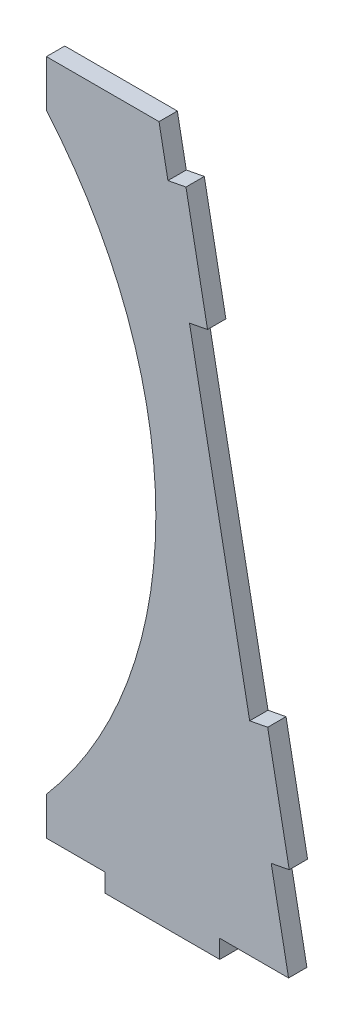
ISO-10303-21;
HEADER;
FILE_DESCRIPTION(('STEP AP214'),'2;1');
FILE_NAME('part.step','',(''),(''),'','','');
FILE_SCHEMA(('AUTOMOTIVE_DESIGN { 1 0 10303 214 1 1 1 1 }'));
ENDSEC;
DATA;
#1=APPLICATION_CONTEXT('core data for automotive mechanical design processes');
#2=APPLICATION_PROTOCOL_DEFINITION('international standard','automotive_design',2000,#1);
#3=PRODUCT_CONTEXT('',#1,'mechanical');
#4=PRODUCT('Part','Part','',(#3));
#5=PRODUCT_RELATED_PRODUCT_CATEGORY('part','',(#4));
#6=PRODUCT_DEFINITION_FORMATION('','',#4);
#7=PRODUCT_DEFINITION_CONTEXT('part definition',#1,'design');
#8=PRODUCT_DEFINITION('design','',#6,#7);
#9=PRODUCT_DEFINITION_SHAPE('','',#8);
#10=(LENGTH_UNIT() NAMED_UNIT(*) SI_UNIT(.MILLI.,.METRE.));
#11=(NAMED_UNIT(*) PLANE_ANGLE_UNIT() SI_UNIT($,.RADIAN.));
#12=(NAMED_UNIT(*) SI_UNIT($,.STERADIAN.) SOLID_ANGLE_UNIT());
#13=UNCERTAINTY_MEASURE_WITH_UNIT(LENGTH_MEASURE(1.E-05),#10,'distance_accuracy_value','');
#14=(GEOMETRIC_REPRESENTATION_CONTEXT(3) GLOBAL_UNCERTAINTY_ASSIGNED_CONTEXT((#13)) GLOBAL_UNIT_ASSIGNED_CONTEXT((#10,
#11,#12)) REPRESENTATION_CONTEXT('',''));
#15=CARTESIAN_POINT('',(0.,0.,0.));
#16=DIRECTION('',(0.,0.,1.));
#17=DIRECTION('',(1.,0.,0.));
#18=AXIS2_PLACEMENT_3D('',#15,#16,#17);
#19=CARTESIAN_POINT('',(28.5736769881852,1.143,1.524));
#20=DIRECTION('',(0.,1.,0.));
#21=DIRECTION('',(0.,0.,1.));
#22=AXIS2_PLACEMENT_3D('',#19,#20,#21);
#23=PLANE('',#22);
#24=DIRECTION('',(1.,0.,0.));
#25=VECTOR('',#24,1.);
#26=CARTESIAN_POINT('',(28.5736769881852,1.143,0.));
#27=LINE('',#26,#25);
#28=CARTESIAN_POINT('',(28.5736769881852,1.143,0.));
#29=VERTEX_POINT('',#28);
#30=CARTESIAN_POINT('',(33.443650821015,1.143,0.));
#31=VERTEX_POINT('',#30);
#32=EDGE_CURVE('E192',#29,#31,#27,.T.);
#33=ORIENTED_EDGE('',*,*,#32,.T.);
#34=DIRECTION('',(0.,0.,-1.));
#35=VECTOR('',#34,1.);
#36=CARTESIAN_POINT('',(33.443650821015,1.143,1.524));
#37=LINE('',#36,#35);
#38=CARTESIAN_POINT('',(33.443650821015,1.143,1.524));
#39=VERTEX_POINT('',#38);
#40=EDGE_CURVE('E11',#39,#31,#37,.T.);
#41=ORIENTED_EDGE('',*,*,#40,.F.);
#42=DIRECTION('',(1.,0.,0.));
#43=VECTOR('',#42,1.);
#44=CARTESIAN_POINT('',(28.5736769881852,1.143,1.524));
#45=LINE('',#44,#43);
#46=CARTESIAN_POINT('',(28.5736769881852,1.143,1.524));
#47=VERTEX_POINT('',#46);
#48=EDGE_CURVE('E226',#47,#39,#45,.T.);
#49=ORIENTED_EDGE('',*,*,#48,.F.);
#50=DIRECTION('',(0.,0.,-1.));
#51=VECTOR('',#50,1.);
#52=CARTESIAN_POINT('',(28.5736769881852,1.143,1.524));
#53=LINE('',#52,#51);
#54=EDGE_CURVE('E188',#47,#29,#53,.T.);
#55=ORIENTED_EDGE('',*,*,#54,.T.);
#56=EDGE_LOOP('',(#33,#41,#49,#55));
#57=FACE_BOUND('',#56,.T.);
#58=ADVANCED_FACE('F36',(#57),#23,.F.);
#59=CARTESIAN_POINT('',(33.443650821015,1.143,1.524));
#60=DIRECTION('',(1.,0.,0.));
#61=DIRECTION('',(0.,0.,-1.));
#62=AXIS2_PLACEMENT_3D('',#59,#60,#61);
#63=PLANE('',#62);
#64=DIRECTION('',(0.,-1.,0.));
#65=VECTOR('',#64,1.);
#66=CARTESIAN_POINT('',(33.443650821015,1.143,0.));
#67=LINE('',#66,#65);
#68=CARTESIAN_POINT('',(33.443650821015,-0.381,0.));
#69=VERTEX_POINT('',#68);
#70=EDGE_CURVE('E195',#31,#69,#67,.T.);
#71=ORIENTED_EDGE('',*,*,#70,.T.);
#72=DIRECTION('',(0.,0.,-1.));
#73=VECTOR('',#72,1.);
#74=CARTESIAN_POINT('',(33.443650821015,-0.381,1.524));
#75=LINE('',#74,#73);
#76=CARTESIAN_POINT('',(33.443650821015,-0.381,1.524));
#77=VERTEX_POINT('',#76);
#78=EDGE_CURVE('E44',#77,#69,#75,.T.);
#79=ORIENTED_EDGE('',*,*,#78,.F.);
#80=DIRECTION('',(0.,-1.,0.));
#81=VECTOR('',#80,1.);
#82=CARTESIAN_POINT('',(33.443650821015,1.143,1.524));
#83=LINE('',#82,#81);
#84=EDGE_CURVE('E125',#39,#77,#83,.T.);
#85=ORIENTED_EDGE('',*,*,#84,.F.);
#86=ORIENTED_EDGE('',*,*,#40,.T.);
#87=EDGE_LOOP('',(#71,#79,#85,#86));
#88=FACE_BOUND('',#87,.T.);
#89=ADVANCED_FACE('F334',(#88),#63,.F.);
#90=CARTESIAN_POINT('',(33.443650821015,-0.381,1.524));
#91=DIRECTION('',(0.,1.,0.));
#92=DIRECTION('',(0.,0.,1.));
#93=AXIS2_PLACEMENT_3D('',#90,#91,#92);
#94=PLANE('',#93);
#95=DIRECTION('',(1.,0.,0.));
#96=VECTOR('',#95,1.);
#97=CARTESIAN_POINT('',(33.443650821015,-0.381,0.));
#98=LINE('',#97,#96);
#99=CARTESIAN_POINT('',(42.968650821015,-0.381,0.));
#100=VERTEX_POINT('',#99);
#101=EDGE_CURVE('E197',#69,#100,#98,.T.);
#102=ORIENTED_EDGE('',*,*,#101,.T.);
#103=DIRECTION('',(0.,0.,-1.));
#104=VECTOR('',#103,1.);
#105=CARTESIAN_POINT('',(42.968650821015,-0.381,1.524));
#106=LINE('',#105,#104);
#107=CARTESIAN_POINT('',(42.968650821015,-0.381,1.524));
#108=VERTEX_POINT('',#107);
#109=EDGE_CURVE('E263',#108,#100,#106,.T.);
#110=ORIENTED_EDGE('',*,*,#109,.F.);
#111=DIRECTION('',(1.,0.,0.));
#112=VECTOR('',#111,1.);
#113=CARTESIAN_POINT('',(33.443650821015,-0.381,1.524));
#114=LINE('',#113,#112);
#115=EDGE_CURVE('E271',#77,#108,#114,.T.);
#116=ORIENTED_EDGE('',*,*,#115,.F.);
#117=ORIENTED_EDGE('',*,*,#78,.T.);
#118=EDGE_LOOP('',(#102,#110,#116,#117));
#119=FACE_BOUND('',#118,.T.);
#120=ADVANCED_FACE('F269',(#119),#94,.F.);
#121=CARTESIAN_POINT('',(42.968650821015,-0.381,1.524));
#122=DIRECTION('',(-1.,0.,0.));
#123=DIRECTION('',(0.,0.,1.));
#124=AXIS2_PLACEMENT_3D('',#121,#122,#123);
#125=PLANE('',#124);
#126=DIRECTION('',(0.,1.,0.));
#127=VECTOR('',#126,1.);
#128=CARTESIAN_POINT('',(42.968650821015,-0.381,0.));
#129=LINE('',#128,#127);
#130=CARTESIAN_POINT('',(42.968650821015,1.143,0.));
#131=VERTEX_POINT('',#130);
#132=EDGE_CURVE('E199',#100,#131,#129,.T.);
#133=ORIENTED_EDGE('',*,*,#132,.T.);
#134=DIRECTION('',(0.,0.,-1.));
#135=VECTOR('',#134,1.);
#136=CARTESIAN_POINT('',(42.968650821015,1.143,1.524));
#137=LINE('',#136,#135);
#138=CARTESIAN_POINT('',(42.968650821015,1.143,1.524));
#139=VERTEX_POINT('',#138);
#140=EDGE_CURVE('E260',#139,#131,#137,.T.);
#141=ORIENTED_EDGE('',*,*,#140,.F.);
#142=DIRECTION('',(0.,1.,0.));
#143=VECTOR('',#142,1.);
#144=CARTESIAN_POINT('',(42.968650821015,-0.381,1.524));
#145=LINE('',#144,#143);
#146=EDGE_CURVE('E289',#108,#139,#145,.T.);
#147=ORIENTED_EDGE('',*,*,#146,.F.);
#148=ORIENTED_EDGE('',*,*,#109,.T.);
#149=EDGE_LOOP('',(#133,#141,#147,#148));
#150=FACE_BOUND('',#149,.T.);
#151=ADVANCED_FACE('F280',(#150),#125,.F.);
#152=CARTESIAN_POINT('',(42.968650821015,1.143,1.524));
#153=DIRECTION('',(0.,1.,0.));
#154=DIRECTION('',(-1.,0.,0.));
#155=AXIS2_PLACEMENT_3D('',#152,#153,#154);
#156=PLANE('',#155);
#157=DIRECTION('',(1.,0.,0.));
#158=VECTOR('',#157,1.);
#159=CARTESIAN_POINT('',(42.968650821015,1.143,0.));
#160=LINE('',#159,#158);
#161=CARTESIAN_POINT('',(48.6841008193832,1.14300000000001,0.));
#162=VERTEX_POINT('',#161);
#163=EDGE_CURVE('E201',#131,#162,#160,.T.);
#164=ORIENTED_EDGE('',*,*,#163,.T.);
#165=DIRECTION('',(0.,0.,-1.));
#166=VECTOR('',#165,1.);
#167=CARTESIAN_POINT('',(48.6841008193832,1.14300000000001,1.524));
#168=LINE('',#167,#166);
#169=CARTESIAN_POINT('',(48.6841008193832,1.14300000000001,1.524));
#170=VERTEX_POINT('',#169);
#171=EDGE_CURVE('E257',#170,#162,#168,.T.);
#172=ORIENTED_EDGE('',*,*,#171,.F.);
#173=DIRECTION('',(1.,0.,0.));
#174=VECTOR('',#173,1.);
#175=CARTESIAN_POINT('',(42.968650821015,1.143,1.524));
#176=LINE('',#175,#174);
#177=EDGE_CURVE('E286',#139,#170,#176,.T.);
#178=ORIENTED_EDGE('',*,*,#177,.F.);
#179=ORIENTED_EDGE('',*,*,#140,.T.);
#180=EDGE_LOOP('',(#164,#172,#178,#179));
#181=FACE_BOUND('',#180,.T.);
#182=ADVANCED_FACE('F284',(#181),#156,.F.);
#183=CARTESIAN_POINT('',(48.6841008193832,1.14300000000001,1.524));
#184=DIRECTION('',(-0.982176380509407,-0.187961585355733,0.));
#185=DIRECTION('',(0.187961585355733,-0.982176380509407,0.));
#186=AXIS2_PLACEMENT_3D('',#183,#184,#185);
#187=PLANE('',#186);
#188=DIRECTION('',(-0.187961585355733,0.982176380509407,0.));
#189=VECTOR('',#188,1.);
#190=CARTESIAN_POINT('',(48.6841008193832,1.14300000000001,0.));
#191=LINE('',#190,#189);
#192=CARTESIAN_POINT('',(47.2435297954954,8.67057448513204,0.));
#193=VERTEX_POINT('',#192);
#194=EDGE_CURVE('E203',#162,#193,#191,.T.);
#195=ORIENTED_EDGE('',*,*,#194,.T.);
#196=DIRECTION('',(0.,0.,-1.));
#197=VECTOR('',#196,1.);
#198=CARTESIAN_POINT('',(47.2435297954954,8.67057448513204,1.524));
#199=LINE('',#198,#197);
#200=CARTESIAN_POINT('',(47.2435297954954,8.67057448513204,1.524));
#201=VERTEX_POINT('',#200);
#202=EDGE_CURVE('E254',#201,#193,#199,.T.);
#203=ORIENTED_EDGE('',*,*,#202,.F.);
#204=DIRECTION('',(-0.187961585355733,0.982176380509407,0.));
#205=VECTOR('',#204,1.);
#206=CARTESIAN_POINT('',(48.6841008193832,1.14300000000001,1.524));
#207=LINE('',#206,#205);
#208=EDGE_CURVE('E288',#170,#201,#207,.T.);
#209=ORIENTED_EDGE('',*,*,#208,.F.);
#210=ORIENTED_EDGE('',*,*,#171,.T.);
#211=EDGE_LOOP('',(#195,#203,#209,#210));
#212=FACE_BOUND('',#211,.T.);
#213=ADVANCED_FACE('F347',(#212),#187,.F.);
#214=CARTESIAN_POINT('',(47.2435297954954,8.67057448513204,1.524));
#215=DIRECTION('',(-0.187961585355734,0.982176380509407,0.));
#216=DIRECTION('',(-0.982176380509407,-0.187961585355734,0.));
#217=AXIS2_PLACEMENT_3D('',#214,#215,#216);
#218=PLANE('',#217);
#219=DIRECTION('',(0.982176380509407,0.187961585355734,0.));
#220=VECTOR('',#219,1.);
#221=CARTESIAN_POINT('',(47.2435297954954,8.67057448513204,0.));
#222=LINE('',#221,#220);
#223=CARTESIAN_POINT('',(48.7403665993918,8.95702794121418,0.));
#224=VERTEX_POINT('',#223);
#225=EDGE_CURVE('E205',#193,#224,#222,.T.);
#226=ORIENTED_EDGE('',*,*,#225,.T.);
#227=DIRECTION('',(0.,0.,-1.));
#228=VECTOR('',#227,1.);
#229=CARTESIAN_POINT('',(48.7403665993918,8.95702794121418,1.524));
#230=LINE('',#229,#228);
#231=CARTESIAN_POINT('',(48.7403665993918,8.95702794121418,1.524));
#232=VERTEX_POINT('',#231);
#233=EDGE_CURVE('E251',#232,#224,#230,.T.);
#234=ORIENTED_EDGE('',*,*,#233,.F.);
#235=DIRECTION('',(0.982176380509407,0.187961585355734,0.));
#236=VECTOR('',#235,1.);
#237=CARTESIAN_POINT('',(47.2435297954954,8.67057448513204,1.524));
#238=LINE('',#237,#236);
#239=EDGE_CURVE('E291',#201,#232,#238,.T.);
#240=ORIENTED_EDGE('',*,*,#239,.F.);
#241=ORIENTED_EDGE('',*,*,#202,.T.);
#242=EDGE_LOOP('',(#226,#234,#240,#241));
#243=FACE_BOUND('',#242,.T.);
#244=ADVANCED_FACE('F350',(#243),#218,.F.);
#245=CARTESIAN_POINT('',(48.7403665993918,8.95702794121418,1.524));
#246=DIRECTION('',(-0.982176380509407,-0.187961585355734,0.));
#247=DIRECTION('',(0.187961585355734,-0.982176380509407,0.));
#248=AXIS2_PLACEMENT_3D('',#245,#246,#247);
#249=PLANE('',#248);
#250=DIRECTION('',(-0.187961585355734,0.982176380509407,0.));
#251=VECTOR('',#250,1.);
#252=CARTESIAN_POINT('',(48.7403665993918,8.95702794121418,0.));
#253=LINE('',#252,#251);
#254=CARTESIAN_POINT('',(46.9500324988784,18.3122579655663,0.));
#255=VERTEX_POINT('',#254);
#256=EDGE_CURVE('E207',#224,#255,#253,.T.);
#257=ORIENTED_EDGE('',*,*,#256,.T.);
#258=DIRECTION('',(0.,0.,-1.));
#259=VECTOR('',#258,1.);
#260=CARTESIAN_POINT('',(46.9500324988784,18.3122579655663,1.524));
#261=LINE('',#260,#259);
#262=CARTESIAN_POINT('',(46.9500324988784,18.3122579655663,1.524));
#263=VERTEX_POINT('',#262);
#264=EDGE_CURVE('E248',#263,#255,#261,.T.);
#265=ORIENTED_EDGE('',*,*,#264,.F.);
#266=DIRECTION('',(-0.187961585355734,0.982176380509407,0.));
#267=VECTOR('',#266,1.);
#268=CARTESIAN_POINT('',(48.7403665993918,8.95702794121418,1.524));
#269=LINE('',#268,#267);
#270=EDGE_CURVE('E297',#232,#263,#269,.T.);
#271=ORIENTED_EDGE('',*,*,#270,.F.);
#272=ORIENTED_EDGE('',*,*,#233,.T.);
#273=EDGE_LOOP('',(#257,#265,#271,#272));
#274=FACE_BOUND('',#273,.T.);
#275=ADVANCED_FACE('F354',(#274),#249,.F.);
#276=CARTESIAN_POINT('',(45.4531956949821,18.0258045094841,1.524));
#277=DIRECTION('',(0.187961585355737,-0.982176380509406,0.));
#278=DIRECTION('',(0.982176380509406,0.187961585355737,0.));
#279=AXIS2_PLACEMENT_3D('',#276,#277,#278);
#280=PLANE('',#279);
#281=DIRECTION('',(-0.982176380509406,-0.187961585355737,0.));
#282=VECTOR('',#281,1.);
#283=CARTESIAN_POINT('',(45.4531956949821,18.0258045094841,0.));
#284=LINE('',#283,#282);
#285=CARTESIAN_POINT('',(45.4531956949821,18.0258045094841,0.));
#286=VERTEX_POINT('',#285);
#287=EDGE_CURVE('E209',#255,#286,#284,.T.);
#288=ORIENTED_EDGE('',*,*,#287,.T.);
#289=DIRECTION('',(0.,0.,-1.));
#290=VECTOR('',#289,1.);
#291=CARTESIAN_POINT('',(45.4531956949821,18.0258045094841,1.524));
#292=LINE('',#291,#290);
#293=CARTESIAN_POINT('',(45.4531956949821,18.0258045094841,1.524));
#294=VERTEX_POINT('',#293);
#295=EDGE_CURVE('E245',#294,#286,#292,.T.);
#296=ORIENTED_EDGE('',*,*,#295,.F.);
#297=DIRECTION('',(-0.982176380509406,-0.187961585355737,0.));
#298=VECTOR('',#297,1.);
#299=CARTESIAN_POINT('',(45.4531956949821,18.0258045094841,1.524));
#300=LINE('',#299,#298);
#301=EDGE_CURVE('E299',#263,#294,#300,.T.);
#302=ORIENTED_EDGE('',*,*,#301,.F.);
#303=ORIENTED_EDGE('',*,*,#264,.T.);
#304=EDGE_LOOP('',(#288,#296,#302,#303));
#305=FACE_BOUND('',#304,.T.);
#306=ADVANCED_FACE('F358',(#305),#280,.F.);
#307=CARTESIAN_POINT('',(45.4531956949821,18.0258045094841,1.524));
#308=DIRECTION('',(-0.982176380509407,-0.187961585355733,0.));
#309=DIRECTION('',(0.187961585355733,-0.982176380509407,0.));
#310=AXIS2_PLACEMENT_3D('',#307,#308,#309);
#311=PLANE('',#310);
#312=DIRECTION('',(-0.187961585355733,0.982176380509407,0.));
#313=VECTOR('',#312,1.);
#314=CARTESIAN_POINT('',(45.4531956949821,18.0258045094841,0.));
#315=LINE('',#314,#313);
#316=CARTESIAN_POINT('',(40.456787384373,44.1340873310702,0.));
#317=VERTEX_POINT('',#316);
#318=EDGE_CURVE('E211',#286,#317,#315,.T.);
#319=ORIENTED_EDGE('',*,*,#318,.T.);
#320=DIRECTION('',(0.,0.,-1.));
#321=VECTOR('',#320,1.);
#322=CARTESIAN_POINT('',(40.456787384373,44.1340873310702,1.524));
#323=LINE('',#322,#321);
#324=CARTESIAN_POINT('',(40.456787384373,44.1340873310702,1.524));
#325=VERTEX_POINT('',#324);
#326=EDGE_CURVE('E242',#325,#317,#323,.T.);
#327=ORIENTED_EDGE('',*,*,#326,.F.);
#328=DIRECTION('',(-0.187961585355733,0.982176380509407,0.));
#329=VECTOR('',#328,1.);
#330=CARTESIAN_POINT('',(45.4531956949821,18.0258045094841,1.524));
#331=LINE('',#330,#329);
#332=EDGE_CURVE('E301',#294,#325,#331,.T.);
#333=ORIENTED_EDGE('',*,*,#332,.F.);
#334=ORIENTED_EDGE('',*,*,#295,.T.);
#335=EDGE_LOOP('',(#319,#327,#333,#334));
#336=FACE_BOUND('',#335,.T.);
#337=ADVANCED_FACE('F362',(#336),#311,.F.);
#338=CARTESIAN_POINT('',(40.456787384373,44.1340873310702,1.524));
#339=DIRECTION('',(-0.187961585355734,0.982176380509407,0.));
#340=DIRECTION('',(-0.982176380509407,-0.187961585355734,0.));
#341=AXIS2_PLACEMENT_3D('',#338,#339,#340);
#342=PLANE('',#341);
#343=DIRECTION('',(0.982176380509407,0.187961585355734,0.));
#344=VECTOR('',#343,1.);
#345=CARTESIAN_POINT('',(40.456787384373,44.1340873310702,0.));
#346=LINE('',#345,#344);
#347=CARTESIAN_POINT('',(41.9536241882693,44.4205407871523,0.));
#348=VERTEX_POINT('',#347);
#349=EDGE_CURVE('E213',#317,#348,#346,.T.);
#350=ORIENTED_EDGE('',*,*,#349,.T.);
#351=DIRECTION('',(0.,0.,-1.));
#352=VECTOR('',#351,1.);
#353=CARTESIAN_POINT('',(41.9536241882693,44.4205407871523,1.524));
#354=LINE('',#353,#352);
#355=CARTESIAN_POINT('',(41.9536241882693,44.4205407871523,1.524));
#356=VERTEX_POINT('',#355);
#357=EDGE_CURVE('E239',#356,#348,#354,.T.);
#358=ORIENTED_EDGE('',*,*,#357,.F.);
#359=DIRECTION('',(0.982176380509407,0.187961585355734,0.));
#360=VECTOR('',#359,1.);
#361=CARTESIAN_POINT('',(40.456787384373,44.1340873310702,1.524));
#362=LINE('',#361,#360);
#363=EDGE_CURVE('E303',#325,#356,#362,.T.);
#364=ORIENTED_EDGE('',*,*,#363,.F.);
#365=ORIENTED_EDGE('',*,*,#326,.T.);
#366=EDGE_LOOP('',(#350,#358,#364,#365));
#367=FACE_BOUND('',#366,.T.);
#368=ADVANCED_FACE('F366',(#367),#342,.F.);
#369=CARTESIAN_POINT('',(41.9536241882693,44.4205407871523,1.524));
#370=DIRECTION('',(-0.982176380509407,-0.187961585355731,0.));
#371=DIRECTION('',(0.187961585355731,-0.982176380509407,0.));
#372=AXIS2_PLACEMENT_3D('',#369,#370,#371);
#373=PLANE('',#372);
#374=DIRECTION('',(-0.187961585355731,0.982176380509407,0.));
#375=VECTOR('',#374,1.);
#376=CARTESIAN_POINT('',(41.9536241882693,44.4205407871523,0.));
#377=LINE('',#376,#375);
#378=CARTESIAN_POINT('',(40.163290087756,53.7757708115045,0.));
#379=VERTEX_POINT('',#378);
#380=EDGE_CURVE('E215',#348,#379,#377,.T.);
#381=ORIENTED_EDGE('',*,*,#380,.T.);
#382=DIRECTION('',(0.,0.,-1.));
#383=VECTOR('',#382,1.);
#384=CARTESIAN_POINT('',(40.163290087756,53.7757708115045,1.524));
#385=LINE('',#384,#383);
#386=CARTESIAN_POINT('',(40.163290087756,53.7757708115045,1.524));
#387=VERTEX_POINT('',#386);
#388=EDGE_CURVE('E236',#387,#379,#385,.T.);
#389=ORIENTED_EDGE('',*,*,#388,.F.);
#390=DIRECTION('',(-0.187961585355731,0.982176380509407,0.));
#391=VECTOR('',#390,1.);
#392=CARTESIAN_POINT('',(41.9536241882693,44.4205407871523,1.524));
#393=LINE('',#392,#391);
#394=EDGE_CURVE('E305',#356,#387,#393,.T.);
#395=ORIENTED_EDGE('',*,*,#394,.F.);
#396=ORIENTED_EDGE('',*,*,#357,.T.);
#397=EDGE_LOOP('',(#381,#389,#395,#396));
#398=FACE_BOUND('',#397,.T.);
#399=ADVANCED_FACE('F370',(#398),#373,.F.);
#400=CARTESIAN_POINT('',(38.6664532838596,53.4893173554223,1.524));
#401=DIRECTION('',(0.187961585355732,-0.982176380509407,0.));
#402=DIRECTION('',(0.982176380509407,0.187961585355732,0.));
#403=AXIS2_PLACEMENT_3D('',#400,#401,#402);
#404=PLANE('',#403);
#405=DIRECTION('',(-0.982176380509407,-0.187961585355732,0.));
#406=VECTOR('',#405,1.);
#407=CARTESIAN_POINT('',(38.6664532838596,53.4893173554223,0.));
#408=LINE('',#407,#406);
#409=CARTESIAN_POINT('',(38.6664532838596,53.4893173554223,0.));
#410=VERTEX_POINT('',#409);
#411=EDGE_CURVE('E217',#379,#410,#408,.T.);
#412=ORIENTED_EDGE('',*,*,#411,.T.);
#413=DIRECTION('',(0.,0.,-1.));
#414=VECTOR('',#413,1.);
#415=CARTESIAN_POINT('',(38.6664532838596,53.4893173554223,1.524));
#416=LINE('',#415,#414);
#417=CARTESIAN_POINT('',(38.6664532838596,53.4893173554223,1.524));
#418=VERTEX_POINT('',#417);
#419=EDGE_CURVE('E233',#418,#410,#416,.T.);
#420=ORIENTED_EDGE('',*,*,#419,.F.);
#421=DIRECTION('',(-0.982176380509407,-0.187961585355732,0.));
#422=VECTOR('',#421,1.);
#423=CARTESIAN_POINT('',(38.6664532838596,53.4893173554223,1.524));
#424=LINE('',#423,#422);
#425=EDGE_CURVE('E307',#387,#418,#424,.T.);
#426=ORIENTED_EDGE('',*,*,#425,.F.);
#427=ORIENTED_EDGE('',*,*,#388,.T.);
#428=EDGE_LOOP('',(#412,#420,#426,#427));
#429=FACE_BOUND('',#428,.T.);
#430=ADVANCED_FACE('F374',(#429),#404,.F.);
#431=CARTESIAN_POINT('',(38.6664532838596,53.4893173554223,1.524));
#432=DIRECTION('',(-0.982176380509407,-0.187961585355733,0.));
#433=DIRECTION('',(0.187961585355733,-0.982176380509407,0.));
#434=AXIS2_PLACEMENT_3D('',#431,#432,#433);
#435=PLANE('',#434);
#436=DIRECTION('',(-0.187961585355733,0.982176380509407,0.));
#437=VECTOR('',#436,1.);
#438=CARTESIAN_POINT('',(38.6664532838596,53.4893173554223,0.));
#439=LINE('',#438,#437);
#440=CARTESIAN_POINT('',(37.9255109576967,57.3610449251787,0.));
#441=VERTEX_POINT('',#440);
#442=EDGE_CURVE('E219',#410,#441,#439,.T.);
#443=ORIENTED_EDGE('',*,*,#442,.T.);
#444=DIRECTION('',(0.,0.,-1.));
#445=VECTOR('',#444,1.);
#446=CARTESIAN_POINT('',(37.9255109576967,57.3610449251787,1.524));
#447=LINE('',#446,#445);
#448=CARTESIAN_POINT('',(37.9255109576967,57.3610449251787,1.524));
#449=VERTEX_POINT('',#448);
#450=EDGE_CURVE('E230',#449,#441,#447,.T.);
#451=ORIENTED_EDGE('',*,*,#450,.F.);
#452=DIRECTION('',(-0.187961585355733,0.982176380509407,0.));
#453=VECTOR('',#452,1.);
#454=CARTESIAN_POINT('',(38.6664532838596,53.4893173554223,1.524));
#455=LINE('',#454,#453);
#456=EDGE_CURVE('E309',#418,#449,#455,.T.);
#457=ORIENTED_EDGE('',*,*,#456,.F.);
#458=ORIENTED_EDGE('',*,*,#419,.T.);
#459=EDGE_LOOP('',(#443,#451,#457,#458));
#460=FACE_BOUND('',#459,.T.);
#461=ADVANCED_FACE('F315',(#460),#435,.F.);
#462=CARTESIAN_POINT('',(37.9255109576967,57.3610449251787,1.524));
#463=DIRECTION('',(0.,-1.,0.));
#464=DIRECTION('',(0.,0.,-1.));
#465=AXIS2_PLACEMENT_3D('',#462,#463,#464);
#466=PLANE('',#465);
#467=DIRECTION('',(-1.,0.,0.));
#468=VECTOR('',#467,1.);
#469=CARTESIAN_POINT('',(37.9255109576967,57.3610449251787,0.));
#470=LINE('',#469,#468);
#471=CARTESIAN_POINT('',(28.5736769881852,57.3610449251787,0.));
#472=VERTEX_POINT('',#471);
#473=EDGE_CURVE('E221',#441,#472,#470,.T.);
#474=ORIENTED_EDGE('',*,*,#473,.T.);
#475=DIRECTION('',(0.,0.,-1.));
#476=VECTOR('',#475,1.);
#477=CARTESIAN_POINT('',(28.5736769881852,57.3610449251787,1.524));
#478=LINE('',#477,#476);
#479=CARTESIAN_POINT('',(28.5736769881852,57.3610449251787,1.524));
#480=VERTEX_POINT('',#479);
#481=EDGE_CURVE('E183',#480,#472,#478,.T.);
#482=ORIENTED_EDGE('',*,*,#481,.F.);
#483=DIRECTION('',(-1.,0.,0.));
#484=VECTOR('',#483,1.);
#485=CARTESIAN_POINT('',(37.9255109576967,57.3610449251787,1.524));
#486=LINE('',#485,#484);
#487=EDGE_CURVE('E174',#449,#480,#486,.T.);
#488=ORIENTED_EDGE('',*,*,#487,.F.);
#489=ORIENTED_EDGE('',*,*,#450,.T.);
#490=EDGE_LOOP('',(#474,#482,#488,#489));
#491=FACE_BOUND('',#490,.T.);
#492=ADVANCED_FACE('F319',(#491),#466,.F.);
#493=CARTESIAN_POINT('',(28.5736769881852,57.3610449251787,1.524));
#494=DIRECTION('',(1.,0.,0.));
#495=DIRECTION('',(0.,1.,0.));
#496=AXIS2_PLACEMENT_3D('',#493,#494,#495);
#497=PLANE('',#496);
#498=DIRECTION('',(0.,-1.,0.));
#499=VECTOR('',#498,1.);
#500=CARTESIAN_POINT('',(28.5736769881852,57.3610449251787,0.));
#501=LINE('',#500,#499);
#502=CARTESIAN_POINT('',(28.5736769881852,53.4893173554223,0.));
#503=VERTEX_POINT('',#502);
#504=EDGE_CURVE('E182',#472,#503,#501,.T.);
#505=ORIENTED_EDGE('',*,*,#504,.T.);
#506=DIRECTION('',(0.,0.,-1.));
#507=VECTOR('',#506,1.);
#508=CARTESIAN_POINT('',(28.5736769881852,53.4893173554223,1.524));
#509=LINE('',#508,#507);
#510=CARTESIAN_POINT('',(28.5736769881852,53.4893173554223,1.524));
#511=VERTEX_POINT('',#510);
#512=EDGE_CURVE('E179',#511,#503,#509,.T.);
#513=ORIENTED_EDGE('',*,*,#512,.F.);
#514=DIRECTION('',(0.,-1.,0.));
#515=VECTOR('',#514,1.);
#516=CARTESIAN_POINT('',(28.5736769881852,57.3610449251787,1.524));
#517=LINE('',#516,#515);
#518=EDGE_CURVE('E168',#480,#511,#517,.T.);
#519=ORIENTED_EDGE('',*,*,#518,.F.);
#520=ORIENTED_EDGE('',*,*,#481,.T.);
#521=EDGE_LOOP('',(#505,#513,#519,#520));
#522=FACE_BOUND('',#521,.T.);
#523=ADVANCED_FACE('F180',(#522),#497,.F.);
#524=CARTESIAN_POINT('',(-0.153153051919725,28.8973650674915,1.524));
#525=DIRECTION('',(0.,0.,-1.));
#526=DIRECTION('',(-1.,0.,0.));
#527=AXIS2_PLACEMENT_3D('',#524,#525,#526);
#528=CYLINDRICAL_SURFACE('',#527,37.8152731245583);
#529=CARTESIAN_POINT('',(-0.153153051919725,28.8973650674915,0.));
#530=DIRECTION('',(0.,0.,-1.));
#531=DIRECTION('',(1.,0.,0.));
#532=AXIS2_PLACEMENT_3D('',#529,#530,#531);
#533=CIRCLE('',#532,37.8152731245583);
#534=CARTESIAN_POINT('',(28.5736769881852,4.30541277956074,0.));
#535=VERTEX_POINT('',#534);
#536=EDGE_CURVE('E111',#503,#535,#533,.T.);
#537=ORIENTED_EDGE('',*,*,#536,.T.);
#538=DIRECTION('',(0.,0.,-1.));
#539=VECTOR('',#538,1.);
#540=CARTESIAN_POINT('',(28.5736769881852,4.30541277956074,1.524));
#541=LINE('',#540,#539);
#542=CARTESIAN_POINT('',(28.5736769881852,4.30541277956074,1.524));
#543=VERTEX_POINT('',#542);
#544=EDGE_CURVE('E184',#543,#535,#541,.T.);
#545=ORIENTED_EDGE('',*,*,#544,.F.);
#546=CARTESIAN_POINT('',(-0.153153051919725,28.8973650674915,1.524));
#547=DIRECTION('',(0.,0.,-1.));
#548=DIRECTION('',(1.,0.,0.));
#549=AXIS2_PLACEMENT_3D('',#546,#547,#548);
#550=CIRCLE('',#549,37.8152731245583);
#551=EDGE_CURVE('E172',#511,#543,#550,.T.);
#552=ORIENTED_EDGE('',*,*,#551,.F.);
#553=ORIENTED_EDGE('',*,*,#512,.T.);
#554=EDGE_LOOP('',(#537,#545,#552,#553));
#555=FACE_BOUND('',#554,.T.);
#556=ADVANCED_FACE('F186',(#555),#528,.F.);
#557=CARTESIAN_POINT('',(28.5736769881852,4.30541277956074,1.524));
#558=DIRECTION('',(1.,0.,0.));
#559=DIRECTION('',(0.,0.,-1.));
#560=AXIS2_PLACEMENT_3D('',#557,#558,#559);
#561=PLANE('',#560);
#562=DIRECTION('',(0.,-1.,0.));
#563=VECTOR('',#562,1.);
#564=CARTESIAN_POINT('',(28.5736769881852,4.30541277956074,0.));
#565=LINE('',#564,#563);
#566=EDGE_CURVE('E117',#535,#29,#565,.T.);
#567=ORIENTED_EDGE('',*,*,#566,.T.);
#568=ORIENTED_EDGE('',*,*,#54,.F.);
#569=DIRECTION('',(0.,-1.,0.));
#570=VECTOR('',#569,1.);
#571=CARTESIAN_POINT('',(28.5736769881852,4.30541277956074,1.524));
#572=LINE('',#571,#570);
#573=EDGE_CURVE('E52',#543,#47,#572,.T.);
#574=ORIENTED_EDGE('',*,*,#573,.F.);
#575=ORIENTED_EDGE('',*,*,#544,.T.);
#576=EDGE_LOOP('',(#567,#568,#574,#575));
#577=FACE_BOUND('',#576,.T.);
#578=ADVANCED_FACE('F323',(#577),#561,.F.);
#579=CARTESIAN_POINT('',(-0.153153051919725,28.8973650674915,1.524));
#580=DIRECTION('',(0.,0.,1.));
#581=DIRECTION('',(1.,0.,0.));
#582=AXIS2_PLACEMENT_3D('',#579,#580,#581);
#583=PLANE('',#582);
#584=ORIENTED_EDGE('',*,*,#48,.T.);
#585=ORIENTED_EDGE('',*,*,#84,.T.);
#586=ORIENTED_EDGE('',*,*,#115,.T.);
#587=ORIENTED_EDGE('',*,*,#146,.T.);
#588=ORIENTED_EDGE('',*,*,#177,.T.);
#589=ORIENTED_EDGE('',*,*,#208,.T.);
#590=ORIENTED_EDGE('',*,*,#239,.T.);
#591=ORIENTED_EDGE('',*,*,#270,.T.);
#592=ORIENTED_EDGE('',*,*,#301,.T.);
#593=ORIENTED_EDGE('',*,*,#332,.T.);
#594=ORIENTED_EDGE('',*,*,#363,.T.);
#595=ORIENTED_EDGE('',*,*,#394,.T.);
#596=ORIENTED_EDGE('',*,*,#425,.T.);
#597=ORIENTED_EDGE('',*,*,#456,.T.);
#598=ORIENTED_EDGE('',*,*,#487,.T.);
#599=ORIENTED_EDGE('',*,*,#518,.T.);
#600=ORIENTED_EDGE('',*,*,#551,.T.);
#601=ORIENTED_EDGE('',*,*,#573,.T.);
#602=EDGE_LOOP('',(#584,#585,#586,#587,#588,#589,#590,#591,#592,#593,#594,#595,#596,#597,#598,
#599,#600,#601));
#603=FACE_BOUND('',#602,.T.);
#604=ADVANCED_FACE('F170',(#603),#583,.T.);
#605=CARTESIAN_POINT('',(-0.153153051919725,28.8973650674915,0.));
#606=DIRECTION('',(0.,0.,1.));
#607=DIRECTION('',(1.,0.,0.));
#608=AXIS2_PLACEMENT_3D('',#605,#606,#607);
#609=PLANE('',#608);
#610=ORIENTED_EDGE('',*,*,#32,.F.);
#611=ORIENTED_EDGE('',*,*,#566,.F.);
#612=ORIENTED_EDGE('',*,*,#536,.F.);
#613=ORIENTED_EDGE('',*,*,#504,.F.);
#614=ORIENTED_EDGE('',*,*,#473,.F.);
#615=ORIENTED_EDGE('',*,*,#442,.F.);
#616=ORIENTED_EDGE('',*,*,#411,.F.);
#617=ORIENTED_EDGE('',*,*,#380,.F.);
#618=ORIENTED_EDGE('',*,*,#349,.F.);
#619=ORIENTED_EDGE('',*,*,#318,.F.);
#620=ORIENTED_EDGE('',*,*,#287,.F.);
#621=ORIENTED_EDGE('',*,*,#256,.F.);
#622=ORIENTED_EDGE('',*,*,#225,.F.);
#623=ORIENTED_EDGE('',*,*,#194,.F.);
#624=ORIENTED_EDGE('',*,*,#163,.F.);
#625=ORIENTED_EDGE('',*,*,#132,.F.);
#626=ORIENTED_EDGE('',*,*,#101,.F.);
#627=ORIENTED_EDGE('',*,*,#70,.F.);
#628=EDGE_LOOP('',(#610,#611,#612,#613,#614,#615,#616,#617,#618,#619,#620,#621,#622,#623,#624,
#625,#626,#627));
#629=FACE_BOUND('',#628,.T.);
#630=ADVANCED_FACE('F275',(#629),#609,.F.);
#631=CLOSED_SHELL('',(#58,#89,#120,#151,#182,#213,#244,#275,#306,#337,#368,#399,#430,#461,#492,
#523,#556,#578,#604,#630));
#632=MANIFOLD_SOLID_BREP('B2',#631);
#633=ADVANCED_BREP_SHAPE_REPRESENTATION('',(#18,#632),#14);
#634=SHAPE_DEFINITION_REPRESENTATION(#9,#633);
ENDSEC;
END-ISO-10303-21;
